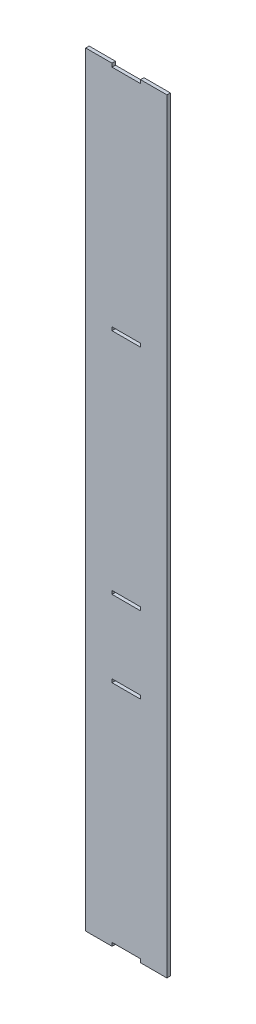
ISO-10303-21;
HEADER;
FILE_DESCRIPTION(('STEP AP214'),'2;1');
FILE_NAME('part.step','',(''),(''),'','','');
FILE_SCHEMA(('AUTOMOTIVE_DESIGN { 1 0 10303 214 1 1 1 1 }'));
ENDSEC;
DATA;
#1=APPLICATION_CONTEXT('core data for automotive mechanical design processes');
#2=APPLICATION_PROTOCOL_DEFINITION('international standard','automotive_design',2000,#1);
#3=PRODUCT_CONTEXT('',#1,'mechanical');
#4=PRODUCT('Part','Part','',(#3));
#5=PRODUCT_RELATED_PRODUCT_CATEGORY('part','',(#4));
#6=PRODUCT_DEFINITION_FORMATION('','',#4);
#7=PRODUCT_DEFINITION_CONTEXT('part definition',#1,'design');
#8=PRODUCT_DEFINITION('design','',#6,#7);
#9=PRODUCT_DEFINITION_SHAPE('','',#8);
#10=(LENGTH_UNIT() NAMED_UNIT(*) SI_UNIT(.MILLI.,.METRE.));
#11=(NAMED_UNIT(*) PLANE_ANGLE_UNIT() SI_UNIT($,.RADIAN.));
#12=(NAMED_UNIT(*) SI_UNIT($,.STERADIAN.) SOLID_ANGLE_UNIT());
#13=UNCERTAINTY_MEASURE_WITH_UNIT(LENGTH_MEASURE(1.E-05),#10,'distance_accuracy_value','');
#14=(GEOMETRIC_REPRESENTATION_CONTEXT(3) GLOBAL_UNCERTAINTY_ASSIGNED_CONTEXT((#13)) GLOBAL_UNIT_ASSIGNED_CONTEXT((#10,
#11,#12)) REPRESENTATION_CONTEXT('',''));
#15=CARTESIAN_POINT('',(0.,0.,0.));
#16=DIRECTION('',(0.,0.,1.));
#17=DIRECTION('',(1.,0.,0.));
#18=AXIS2_PLACEMENT_3D('',#15,#16,#17);
#19=CARTESIAN_POINT('',(0.,0.,1.524));
#20=DIRECTION('',(0.,0.,1.));
#21=DIRECTION('',(1.,0.,0.));
#22=AXIS2_PLACEMENT_3D('',#19,#20,#21);
#23=PLANE('',#22);
#24=DIRECTION('',(-1.,0.,0.));
#25=VECTOR('',#24,1.);
#26=CARTESIAN_POINT('',(6.35,135.649599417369,1.524));
#27=LINE('',#26,#25);
#28=CARTESIAN_POINT('',(6.35,135.649599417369,1.524));
#29=VERTEX_POINT('',#28);
#30=CARTESIAN_POINT('',(-6.35,135.649599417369,1.524));
#31=VERTEX_POINT('',#30);
#32=EDGE_CURVE('E233',#29,#31,#27,.T.);
#33=ORIENTED_EDGE('',*,*,#32,.F.);
#34=DIRECTION('',(0.,1.,0.));
#35=VECTOR('',#34,1.);
#36=CARTESIAN_POINT('',(6.35,135.649599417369,1.524));
#37=LINE('',#36,#35);
#38=CARTESIAN_POINT('',(6.35,134.125599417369,1.524));
#39=VERTEX_POINT('',#38);
#40=EDGE_CURVE('E231',#39,#29,#37,.T.);
#41=ORIENTED_EDGE('',*,*,#40,.F.);
#42=DIRECTION('',(1.,0.,0.));
#43=VECTOR('',#42,1.);
#44=CARTESIAN_POINT('',(6.35,134.125599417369,1.524));
#45=LINE('',#44,#43);
#46=CARTESIAN_POINT('',(-6.35,134.125599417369,1.524));
#47=VERTEX_POINT('',#46);
#48=EDGE_CURVE('E239',#47,#39,#45,.T.);
#49=ORIENTED_EDGE('',*,*,#48,.F.);
#50=DIRECTION('',(0.,-1.,0.));
#51=VECTOR('',#50,1.);
#52=CARTESIAN_POINT('',(-6.35,135.649599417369,1.524));
#53=LINE('',#52,#51);
#54=EDGE_CURVE('E236',#31,#47,#53,.T.);
#55=ORIENTED_EDGE('',*,*,#54,.F.);
#56=EDGE_LOOP('',(#33,#41,#49,#55));
#57=FACE_BOUND('',#56,.T.);
#58=DIRECTION('',(0.,1.,0.));
#59=VECTOR('',#58,1.);
#60=CARTESIAN_POINT('',(18.0600840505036,-1.524,1.524));
#61=LINE('',#60,#59);
#62=CARTESIAN_POINT('',(18.0600840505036,-1.524,1.524));
#63=VERTEX_POINT('',#62);
#64=CARTESIAN_POINT('',(18.0600840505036,338.849599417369,1.524));
#65=VERTEX_POINT('',#64);
#66=EDGE_CURVE('E293',#63,#65,#61,.T.);
#67=ORIENTED_EDGE('',*,*,#66,.T.);
#68=DIRECTION('',(-1.,0.,0.));
#69=VECTOR('',#68,1.);
#70=CARTESIAN_POINT('',(18.0600840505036,338.849599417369,1.524));
#71=LINE('',#70,#69);
#72=CARTESIAN_POINT('',(6.35,338.849599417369,1.524));
#73=VERTEX_POINT('',#72);
#74=EDGE_CURVE('E296',#65,#73,#71,.T.);
#75=ORIENTED_EDGE('',*,*,#74,.T.);
#76=DIRECTION('',(0.,-1.,0.));
#77=VECTOR('',#76,1.);
#78=CARTESIAN_POINT('',(6.35,337.325599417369,1.524));
#79=LINE('',#78,#77);
#80=CARTESIAN_POINT('',(6.35,337.325599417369,1.524));
#81=VERTEX_POINT('',#80);
#82=EDGE_CURVE('E299',#73,#81,#79,.T.);
#83=ORIENTED_EDGE('',*,*,#82,.T.);
#84=DIRECTION('',(-1.,0.,0.));
#85=VECTOR('',#84,1.);
#86=CARTESIAN_POINT('',(-6.35,337.325599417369,1.524));
#87=LINE('',#86,#85);
#88=CARTESIAN_POINT('',(-6.35,337.325599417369,1.524));
#89=VERTEX_POINT('',#88);
#90=EDGE_CURVE('E301',#81,#89,#87,.T.);
#91=ORIENTED_EDGE('',*,*,#90,.T.);
#92=DIRECTION('',(0.,1.,0.));
#93=VECTOR('',#92,1.);
#94=CARTESIAN_POINT('',(-6.35,338.849599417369,1.524));
#95=LINE('',#94,#93);
#96=CARTESIAN_POINT('',(-6.35,338.849599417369,1.524));
#97=VERTEX_POINT('',#96);
#98=EDGE_CURVE('E303',#89,#97,#95,.T.);
#99=ORIENTED_EDGE('',*,*,#98,.T.);
#100=DIRECTION('',(-1.,0.,0.));
#101=VECTOR('',#100,1.);
#102=CARTESIAN_POINT('',(-6.35,338.849599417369,1.524));
#103=LINE('',#102,#101);
#104=CARTESIAN_POINT('',(-18.0600840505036,338.849599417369,1.524));
#105=VERTEX_POINT('',#104);
#106=EDGE_CURVE('E305',#97,#105,#103,.T.);
#107=ORIENTED_EDGE('',*,*,#106,.T.);
#108=DIRECTION('',(0.,-1.,0.));
#109=VECTOR('',#108,1.);
#110=CARTESIAN_POINT('',(-18.0600840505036,-1.524,1.524));
#111=LINE('',#110,#109);
#112=CARTESIAN_POINT('',(-18.0600840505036,-1.524,1.524));
#113=VERTEX_POINT('',#112);
#114=EDGE_CURVE('E307',#105,#113,#111,.T.);
#115=ORIENTED_EDGE('',*,*,#114,.T.);
#116=DIRECTION('',(1.,0.,0.));
#117=VECTOR('',#116,1.);
#118=CARTESIAN_POINT('',(-6.35,-1.524,1.524));
#119=LINE('',#118,#117);
#120=CARTESIAN_POINT('',(-6.35,-1.524,1.524));
#121=VERTEX_POINT('',#120);
#122=EDGE_CURVE('E309',#113,#121,#119,.T.);
#123=ORIENTED_EDGE('',*,*,#122,.T.);
#124=DIRECTION('',(0.,1.,0.));
#125=VECTOR('',#124,1.);
#126=CARTESIAN_POINT('',(-6.35,0.,1.524));
#127=LINE('',#126,#125);
#128=CARTESIAN_POINT('',(-6.35,0.,1.524));
#129=VERTEX_POINT('',#128);
#130=EDGE_CURVE('E311',#121,#129,#127,.T.);
#131=ORIENTED_EDGE('',*,*,#130,.T.);
#132=DIRECTION('',(1.,0.,0.));
#133=VECTOR('',#132,1.);
#134=CARTESIAN_POINT('',(6.35,0.,1.524));
#135=LINE('',#134,#133);
#136=CARTESIAN_POINT('',(6.35,0.,1.524));
#137=VERTEX_POINT('',#136);
#138=EDGE_CURVE('E313',#129,#137,#135,.T.);
#139=ORIENTED_EDGE('',*,*,#138,.T.);
#140=DIRECTION('',(0.,-1.,0.));
#141=VECTOR('',#140,1.);
#142=CARTESIAN_POINT('',(6.35,-1.524,1.524));
#143=LINE('',#142,#141);
#144=CARTESIAN_POINT('',(6.35,-1.524,1.524));
#145=VERTEX_POINT('',#144);
#146=EDGE_CURVE('E315',#137,#145,#143,.T.);
#147=ORIENTED_EDGE('',*,*,#146,.T.);
#148=DIRECTION('',(1.,0.,0.));
#149=VECTOR('',#148,1.);
#150=CARTESIAN_POINT('',(18.0600840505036,-1.524,1.524));
#151=LINE('',#150,#149);
#152=EDGE_CURVE('E317',#145,#63,#151,.T.);
#153=ORIENTED_EDGE('',*,*,#152,.T.);
#154=EDGE_LOOP('',(#67,#75,#83,#91,#99,#107,#115,#123,#131,#139,#147,#153));
#155=FACE_BOUND('',#154,.T.);
#156=DIRECTION('',(-1.,0.,0.));
#157=VECTOR('',#156,1.);
#158=CARTESIAN_POINT('',(6.35,237.249599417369,1.524));
#159=LINE('',#158,#157);
#160=CARTESIAN_POINT('',(6.35,237.249599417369,1.524));
#161=VERTEX_POINT('',#160);
#162=CARTESIAN_POINT('',(-6.35,237.249599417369,1.524));
#163=VERTEX_POINT('',#162);
#164=EDGE_CURVE('E264',#161,#163,#159,.T.);
#165=ORIENTED_EDGE('',*,*,#164,.F.);
#166=DIRECTION('',(0.,1.,0.));
#167=VECTOR('',#166,1.);
#168=CARTESIAN_POINT('',(6.35,237.249599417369,1.524));
#169=LINE('',#168,#167);
#170=CARTESIAN_POINT('',(6.35,235.725599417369,1.524));
#171=VERTEX_POINT('',#170);
#172=EDGE_CURVE('E262',#171,#161,#169,.T.);
#173=ORIENTED_EDGE('',*,*,#172,.F.);
#174=DIRECTION('',(1.,0.,0.));
#175=VECTOR('',#174,1.);
#176=CARTESIAN_POINT('',(6.35,235.725599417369,1.524));
#177=LINE('',#176,#175);
#178=CARTESIAN_POINT('',(-6.35,235.725599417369,1.524));
#179=VERTEX_POINT('',#178);
#180=EDGE_CURVE('E270',#179,#171,#177,.T.);
#181=ORIENTED_EDGE('',*,*,#180,.F.);
#182=DIRECTION('',(0.,-1.,0.));
#183=VECTOR('',#182,1.);
#184=CARTESIAN_POINT('',(-6.35,237.249599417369,1.524));
#185=LINE('',#184,#183);
#186=EDGE_CURVE('E267',#163,#179,#185,.T.);
#187=ORIENTED_EDGE('',*,*,#186,.F.);
#188=EDGE_LOOP('',(#165,#173,#181,#187));
#189=FACE_BOUND('',#188,.T.);
#190=DIRECTION('',(-1.,0.,0.));
#191=VECTOR('',#190,1.);
#192=CARTESIAN_POINT('',(6.35,101.6,1.524));
#193=LINE('',#192,#191);
#194=CARTESIAN_POINT('',(6.35,101.6,1.524));
#195=VERTEX_POINT('',#194);
#196=CARTESIAN_POINT('',(-6.35,101.6,1.524));
#197=VERTEX_POINT('',#196);
#198=EDGE_CURVE('E203',#195,#197,#193,.T.);
#199=ORIENTED_EDGE('',*,*,#198,.F.);
#200=DIRECTION('',(0.,1.,0.));
#201=VECTOR('',#200,1.);
#202=CARTESIAN_POINT('',(6.35,101.6,1.524));
#203=LINE('',#202,#201);
#204=CARTESIAN_POINT('',(6.35,100.076,1.524));
#205=VERTEX_POINT('',#204);
#206=EDGE_CURVE('E195',#205,#195,#203,.T.);
#207=ORIENTED_EDGE('',*,*,#206,.F.);
#208=DIRECTION('',(1.,0.,0.));
#209=VECTOR('',#208,1.);
#210=CARTESIAN_POINT('',(6.35,100.076,1.524));
#211=LINE('',#210,#209);
#212=CARTESIAN_POINT('',(-6.35,100.076,1.524));
#213=VERTEX_POINT('',#212);
#214=EDGE_CURVE('E217',#213,#205,#211,.T.);
#215=ORIENTED_EDGE('',*,*,#214,.F.);
#216=DIRECTION('',(0.,-1.,0.));
#217=VECTOR('',#216,1.);
#218=CARTESIAN_POINT('',(-6.35,101.6,1.524));
#219=LINE('',#218,#217);
#220=EDGE_CURVE('E215',#197,#213,#219,.T.);
#221=ORIENTED_EDGE('',*,*,#220,.F.);
#222=EDGE_LOOP('',(#199,#207,#215,#221));
#223=FACE_BOUND('',#222,.T.);
#224=ADVANCED_FACE('F34',(#57,#155,#189,#223),#23,.T.);
#225=CARTESIAN_POINT('',(0.,0.,0.));
#226=DIRECTION('',(0.,0.,1.));
#227=DIRECTION('',(1.,0.,0.));
#228=AXIS2_PLACEMENT_3D('',#225,#226,#227);
#229=PLANE('',#228);
#230=DIRECTION('',(0.,1.,0.));
#231=VECTOR('',#230,1.);
#232=CARTESIAN_POINT('',(6.35,135.649599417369,0.));
#233=LINE('',#232,#231);
#234=CARTESIAN_POINT('',(6.35,134.125599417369,0.));
#235=VERTEX_POINT('',#234);
#236=CARTESIAN_POINT('',(6.35,135.649599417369,0.));
#237=VERTEX_POINT('',#236);
#238=EDGE_CURVE('E211',#235,#237,#233,.T.);
#239=ORIENTED_EDGE('',*,*,#238,.T.);
#240=DIRECTION('',(-1.,0.,0.));
#241=VECTOR('',#240,1.);
#242=CARTESIAN_POINT('',(6.35,135.649599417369,0.));
#243=LINE('',#242,#241);
#244=CARTESIAN_POINT('',(-6.35,135.649599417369,0.));
#245=VERTEX_POINT('',#244);
#246=EDGE_CURVE('E244',#237,#245,#243,.T.);
#247=ORIENTED_EDGE('',*,*,#246,.T.);
#248=DIRECTION('',(0.,-1.,0.));
#249=VECTOR('',#248,1.);
#250=CARTESIAN_POINT('',(-6.35,135.649599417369,0.));
#251=LINE('',#250,#249);
#252=CARTESIAN_POINT('',(-6.35,134.125599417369,0.));
#253=VERTEX_POINT('',#252);
#254=EDGE_CURVE('E247',#245,#253,#251,.T.);
#255=ORIENTED_EDGE('',*,*,#254,.T.);
#256=DIRECTION('',(1.,0.,0.));
#257=VECTOR('',#256,1.);
#258=CARTESIAN_POINT('',(6.35,134.125599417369,0.));
#259=LINE('',#258,#257);
#260=EDGE_CURVE('E234',#253,#235,#259,.T.);
#261=ORIENTED_EDGE('',*,*,#260,.T.);
#262=EDGE_LOOP('',(#239,#247,#255,#261));
#263=FACE_BOUND('',#262,.T.);
#264=DIRECTION('',(0.,1.,0.));
#265=VECTOR('',#264,1.);
#266=CARTESIAN_POINT('',(18.0600840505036,-1.524,0.));
#267=LINE('',#266,#265);
#268=CARTESIAN_POINT('',(18.0600840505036,-1.524,0.));
#269=VERTEX_POINT('',#268);
#270=CARTESIAN_POINT('',(18.0600840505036,338.849599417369,0.));
#271=VERTEX_POINT('',#270);
#272=EDGE_CURVE('E292',#269,#271,#267,.T.);
#273=ORIENTED_EDGE('',*,*,#272,.F.);
#274=DIRECTION('',(1.,0.,0.));
#275=VECTOR('',#274,1.);
#276=CARTESIAN_POINT('',(18.0600840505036,-1.524,0.));
#277=LINE('',#276,#275);
#278=CARTESIAN_POINT('',(6.35,-1.524,0.));
#279=VERTEX_POINT('',#278);
#280=EDGE_CURVE('E297',#279,#269,#277,.T.);
#281=ORIENTED_EDGE('',*,*,#280,.F.);
#282=DIRECTION('',(0.,-1.,0.));
#283=VECTOR('',#282,1.);
#284=CARTESIAN_POINT('',(6.35,-1.524,0.));
#285=LINE('',#284,#283);
#286=CARTESIAN_POINT('',(6.35,0.,0.));
#287=VERTEX_POINT('',#286);
#288=EDGE_CURVE('E340',#287,#279,#285,.T.);
#289=ORIENTED_EDGE('',*,*,#288,.F.);
#290=DIRECTION('',(1.,0.,0.));
#291=VECTOR('',#290,1.);
#292=CARTESIAN_POINT('',(6.35,0.,0.));
#293=LINE('',#292,#291);
#294=CARTESIAN_POINT('',(-6.35,0.,0.));
#295=VERTEX_POINT('',#294);
#296=EDGE_CURVE('E338',#295,#287,#293,.T.);
#297=ORIENTED_EDGE('',*,*,#296,.F.);
#298=DIRECTION('',(0.,1.,0.));
#299=VECTOR('',#298,1.);
#300=CARTESIAN_POINT('',(-6.35,0.,0.));
#301=LINE('',#300,#299);
#302=CARTESIAN_POINT('',(-6.35,-1.524,0.));
#303=VERTEX_POINT('',#302);
#304=EDGE_CURVE('E336',#303,#295,#301,.T.);
#305=ORIENTED_EDGE('',*,*,#304,.F.);
#306=DIRECTION('',(1.,0.,0.));
#307=VECTOR('',#306,1.);
#308=CARTESIAN_POINT('',(-6.35,-1.524,0.));
#309=LINE('',#308,#307);
#310=CARTESIAN_POINT('',(-18.0600840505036,-1.524,0.));
#311=VERTEX_POINT('',#310);
#312=EDGE_CURVE('E334',#311,#303,#309,.T.);
#313=ORIENTED_EDGE('',*,*,#312,.F.);
#314=DIRECTION('',(0.,-1.,0.));
#315=VECTOR('',#314,1.);
#316=CARTESIAN_POINT('',(-18.0600840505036,-1.524,0.));
#317=LINE('',#316,#315);
#318=CARTESIAN_POINT('',(-18.0600840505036,338.849599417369,0.));
#319=VERTEX_POINT('',#318);
#320=EDGE_CURVE('E332',#319,#311,#317,.T.);
#321=ORIENTED_EDGE('',*,*,#320,.F.);
#322=DIRECTION('',(-1.,0.,0.));
#323=VECTOR('',#322,1.);
#324=CARTESIAN_POINT('',(-6.35,338.849599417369,0.));
#325=LINE('',#324,#323);
#326=CARTESIAN_POINT('',(-6.35,338.849599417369,0.));
#327=VERTEX_POINT('',#326);
#328=EDGE_CURVE('E330',#327,#319,#325,.T.);
#329=ORIENTED_EDGE('',*,*,#328,.F.);
#330=DIRECTION('',(0.,1.,0.));
#331=VECTOR('',#330,1.);
#332=CARTESIAN_POINT('',(-6.35,338.849599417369,0.));
#333=LINE('',#332,#331);
#334=CARTESIAN_POINT('',(-6.35,337.325599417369,0.));
#335=VERTEX_POINT('',#334);
#336=EDGE_CURVE('E328',#335,#327,#333,.T.);
#337=ORIENTED_EDGE('',*,*,#336,.F.);
#338=DIRECTION('',(-1.,0.,0.));
#339=VECTOR('',#338,1.);
#340=CARTESIAN_POINT('',(-6.35,337.325599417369,0.));
#341=LINE('',#340,#339);
#342=CARTESIAN_POINT('',(6.35,337.325599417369,0.));
#343=VERTEX_POINT('',#342);
#344=EDGE_CURVE('E326',#343,#335,#341,.T.);
#345=ORIENTED_EDGE('',*,*,#344,.F.);
#346=DIRECTION('',(0.,-1.,0.));
#347=VECTOR('',#346,1.);
#348=CARTESIAN_POINT('',(6.35,337.325599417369,0.));
#349=LINE('',#348,#347);
#350=CARTESIAN_POINT('',(6.35,338.849599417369,0.));
#351=VERTEX_POINT('',#350);
#352=EDGE_CURVE('E324',#351,#343,#349,.T.);
#353=ORIENTED_EDGE('',*,*,#352,.F.);
#354=DIRECTION('',(-1.,0.,0.));
#355=VECTOR('',#354,1.);
#356=CARTESIAN_POINT('',(18.0600840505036,338.849599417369,0.));
#357=LINE('',#356,#355);
#358=EDGE_CURVE('E322',#271,#351,#357,.T.);
#359=ORIENTED_EDGE('',*,*,#358,.F.);
#360=EDGE_LOOP('',(#273,#281,#289,#297,#305,#313,#321,#329,#337,#345,#353,#359));
#361=FACE_BOUND('',#360,.T.);
#362=DIRECTION('',(0.,1.,0.));
#363=VECTOR('',#362,1.);
#364=CARTESIAN_POINT('',(6.35,237.249599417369,0.));
#365=LINE('',#364,#363);
#366=CARTESIAN_POINT('',(6.35,235.725599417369,0.));
#367=VERTEX_POINT('',#366);
#368=CARTESIAN_POINT('',(6.35,237.249599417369,0.));
#369=VERTEX_POINT('',#368);
#370=EDGE_CURVE('E261',#367,#369,#365,.T.);
#371=ORIENTED_EDGE('',*,*,#370,.T.);
#372=DIRECTION('',(-1.,0.,0.));
#373=VECTOR('',#372,1.);
#374=CARTESIAN_POINT('',(6.35,237.249599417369,0.));
#375=LINE('',#374,#373);
#376=CARTESIAN_POINT('',(-6.35,237.249599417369,0.));
#377=VERTEX_POINT('',#376);
#378=EDGE_CURVE('E275',#369,#377,#375,.T.);
#379=ORIENTED_EDGE('',*,*,#378,.T.);
#380=DIRECTION('',(0.,-1.,0.));
#381=VECTOR('',#380,1.);
#382=CARTESIAN_POINT('',(-6.35,237.249599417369,0.));
#383=LINE('',#382,#381);
#384=CARTESIAN_POINT('',(-6.35,235.725599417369,0.));
#385=VERTEX_POINT('',#384);
#386=EDGE_CURVE('E278',#377,#385,#383,.T.);
#387=ORIENTED_EDGE('',*,*,#386,.T.);
#388=DIRECTION('',(1.,0.,0.));
#389=VECTOR('',#388,1.);
#390=CARTESIAN_POINT('',(6.35,235.725599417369,0.));
#391=LINE('',#390,#389);
#392=EDGE_CURVE('E265',#385,#367,#391,.T.);
#393=ORIENTED_EDGE('',*,*,#392,.T.);
#394=EDGE_LOOP('',(#371,#379,#387,#393));
#395=FACE_BOUND('',#394,.T.);
#396=DIRECTION('',(0.,1.,0.));
#397=VECTOR('',#396,1.);
#398=CARTESIAN_POINT('',(6.35,101.6,0.));
#399=LINE('',#398,#397);
#400=CARTESIAN_POINT('',(6.35,100.076,0.));
#401=VERTEX_POINT('',#400);
#402=CARTESIAN_POINT('',(6.35,101.6,0.));
#403=VERTEX_POINT('',#402);
#404=EDGE_CURVE('E57',#401,#403,#399,.T.);
#405=ORIENTED_EDGE('',*,*,#404,.T.);
#406=DIRECTION('',(-1.,0.,0.));
#407=VECTOR('',#406,1.);
#408=CARTESIAN_POINT('',(6.35,101.6,0.));
#409=LINE('',#408,#407);
#410=CARTESIAN_POINT('',(-6.35,101.6,0.));
#411=VERTEX_POINT('',#410);
#412=EDGE_CURVE('E210',#403,#411,#409,.T.);
#413=ORIENTED_EDGE('',*,*,#412,.T.);
#414=DIRECTION('',(0.,-1.,0.));
#415=VECTOR('',#414,1.);
#416=CARTESIAN_POINT('',(-6.35,101.6,0.));
#417=LINE('',#416,#415);
#418=CARTESIAN_POINT('',(-6.35,100.076,0.));
#419=VERTEX_POINT('',#418);
#420=EDGE_CURVE('E223',#411,#419,#417,.T.);
#421=ORIENTED_EDGE('',*,*,#420,.T.);
#422=DIRECTION('',(1.,0.,0.));
#423=VECTOR('',#422,1.);
#424=CARTESIAN_POINT('',(6.35,100.076,0.));
#425=LINE('',#424,#423);
#426=EDGE_CURVE('E204',#419,#401,#425,.T.);
#427=ORIENTED_EDGE('',*,*,#426,.T.);
#428=EDGE_LOOP('',(#405,#413,#421,#427));
#429=FACE_BOUND('',#428,.T.);
#430=ADVANCED_FACE('F382',(#263,#361,#395,#429),#229,.F.);
#431=CARTESIAN_POINT('',(18.0600840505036,-1.524,1.524));
#432=DIRECTION('',(-1.,0.,0.));
#433=DIRECTION('',(0.,0.,1.));
#434=AXIS2_PLACEMENT_3D('',#431,#432,#433);
#435=PLANE('',#434);
#436=ORIENTED_EDGE('',*,*,#272,.T.);
#437=DIRECTION('',(0.,0.,-1.));
#438=VECTOR('',#437,1.);
#439=CARTESIAN_POINT('',(18.0600840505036,338.849599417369,1.524));
#440=LINE('',#439,#438);
#441=EDGE_CURVE('E11',#65,#271,#440,.T.);
#442=ORIENTED_EDGE('',*,*,#441,.F.);
#443=ORIENTED_EDGE('',*,*,#66,.F.);
#444=DIRECTION('',(0.,0.,-1.));
#445=VECTOR('',#444,1.);
#446=CARTESIAN_POINT('',(18.0600840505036,-1.524,1.524));
#447=LINE('',#446,#445);
#448=EDGE_CURVE('E319',#63,#269,#447,.T.);
#449=ORIENTED_EDGE('',*,*,#448,.T.);
#450=EDGE_LOOP('',(#436,#442,#443,#449));
#451=FACE_BOUND('',#450,.T.);
#452=ADVANCED_FACE('F36',(#451),#435,.F.);
#453=CARTESIAN_POINT('',(18.0600840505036,338.849599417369,1.524));
#454=DIRECTION('',(0.,-1.,0.));
#455=DIRECTION('',(0.,0.,-1.));
#456=AXIS2_PLACEMENT_3D('',#453,#454,#455);
#457=PLANE('',#456);
#458=ORIENTED_EDGE('',*,*,#358,.T.);
#459=DIRECTION('',(0.,0.,-1.));
#460=VECTOR('',#459,1.);
#461=CARTESIAN_POINT('',(6.35,338.849599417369,1.524));
#462=LINE('',#461,#460);
#463=EDGE_CURVE('E42',#73,#351,#462,.T.);
#464=ORIENTED_EDGE('',*,*,#463,.F.);
#465=ORIENTED_EDGE('',*,*,#74,.F.);
#466=ORIENTED_EDGE('',*,*,#441,.T.);
#467=EDGE_LOOP('',(#458,#464,#465,#466));
#468=FACE_BOUND('',#467,.T.);
#469=ADVANCED_FACE('F400',(#468),#457,.F.);
#470=CARTESIAN_POINT('',(6.35,337.325599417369,1.524));
#471=DIRECTION('',(1.,0.,0.));
#472=DIRECTION('',(0.,0.,-1.));
#473=AXIS2_PLACEMENT_3D('',#470,#471,#472);
#474=PLANE('',#473);
#475=ORIENTED_EDGE('',*,*,#352,.T.);
#476=DIRECTION('',(0.,0.,-1.));
#477=VECTOR('',#476,1.);
#478=CARTESIAN_POINT('',(6.35,337.325599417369,1.524));
#479=LINE('',#478,#477);
#480=EDGE_CURVE('E369',#81,#343,#479,.T.);
#481=ORIENTED_EDGE('',*,*,#480,.F.);
#482=ORIENTED_EDGE('',*,*,#82,.F.);
#483=ORIENTED_EDGE('',*,*,#463,.T.);
#484=EDGE_LOOP('',(#475,#481,#482,#483));
#485=FACE_BOUND('',#484,.T.);
#486=ADVANCED_FACE('F376',(#485),#474,.F.);
#487=CARTESIAN_POINT('',(-6.35,337.325599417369,1.524));
#488=DIRECTION('',(0.,-1.,0.));
#489=DIRECTION('',(0.,0.,-1.));
#490=AXIS2_PLACEMENT_3D('',#487,#488,#489);
#491=PLANE('',#490);
#492=ORIENTED_EDGE('',*,*,#344,.T.);
#493=DIRECTION('',(0.,0.,-1.));
#494=VECTOR('',#493,1.);
#495=CARTESIAN_POINT('',(-6.35,337.325599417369,1.524));
#496=LINE('',#495,#494);
#497=EDGE_CURVE('E366',#89,#335,#496,.T.);
#498=ORIENTED_EDGE('',*,*,#497,.F.);
#499=ORIENTED_EDGE('',*,*,#90,.F.);
#500=ORIENTED_EDGE('',*,*,#480,.T.);
#501=EDGE_LOOP('',(#492,#498,#499,#500));
#502=FACE_BOUND('',#501,.T.);
#503=ADVANCED_FACE('F388',(#502),#491,.F.);
#504=CARTESIAN_POINT('',(-6.35,338.849599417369,1.524));
#505=DIRECTION('',(-1.,0.,0.));
#506=DIRECTION('',(0.,0.,1.));
#507=AXIS2_PLACEMENT_3D('',#504,#505,#506);
#508=PLANE('',#507);
#509=ORIENTED_EDGE('',*,*,#336,.T.);
#510=DIRECTION('',(0.,0.,-1.));
#511=VECTOR('',#510,1.);
#512=CARTESIAN_POINT('',(-6.35,338.849599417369,1.524));
#513=LINE('',#512,#511);
#514=EDGE_CURVE('E363',#97,#327,#513,.T.);
#515=ORIENTED_EDGE('',*,*,#514,.F.);
#516=ORIENTED_EDGE('',*,*,#98,.F.);
#517=ORIENTED_EDGE('',*,*,#497,.T.);
#518=EDGE_LOOP('',(#509,#515,#516,#517));
#519=FACE_BOUND('',#518,.T.);
#520=ADVANCED_FACE('F392',(#519),#508,.F.);
#521=CARTESIAN_POINT('',(-6.35,338.849599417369,1.524));
#522=DIRECTION('',(0.,-1.,0.));
#523=DIRECTION('',(0.,0.,-1.));
#524=AXIS2_PLACEMENT_3D('',#521,#522,#523);
#525=PLANE('',#524);
#526=ORIENTED_EDGE('',*,*,#328,.T.);
#527=DIRECTION('',(0.,0.,-1.));
#528=VECTOR('',#527,1.);
#529=CARTESIAN_POINT('',(-18.0600840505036,338.849599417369,1.524));
#530=LINE('',#529,#528);
#531=EDGE_CURVE('E360',#105,#319,#530,.T.);
#532=ORIENTED_EDGE('',*,*,#531,.F.);
#533=ORIENTED_EDGE('',*,*,#106,.F.);
#534=ORIENTED_EDGE('',*,*,#514,.T.);
#535=EDGE_LOOP('',(#526,#532,#533,#534));
#536=FACE_BOUND('',#535,.T.);
#537=ADVANCED_FACE('F433',(#536),#525,.F.);
#538=CARTESIAN_POINT('',(-18.0600840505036,-1.524,1.524));
#539=DIRECTION('',(1.,0.,0.));
#540=DIRECTION('',(0.,0.,-1.));
#541=AXIS2_PLACEMENT_3D('',#538,#539,#540);
#542=PLANE('',#541);
#543=ORIENTED_EDGE('',*,*,#320,.T.);
#544=DIRECTION('',(0.,0.,-1.));
#545=VECTOR('',#544,1.);
#546=CARTESIAN_POINT('',(-18.0600840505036,-1.524,1.524));
#547=LINE('',#546,#545);
#548=EDGE_CURVE('E357',#113,#311,#547,.T.);
#549=ORIENTED_EDGE('',*,*,#548,.F.);
#550=ORIENTED_EDGE('',*,*,#114,.F.);
#551=ORIENTED_EDGE('',*,*,#531,.T.);
#552=EDGE_LOOP('',(#543,#549,#550,#551));
#553=FACE_BOUND('',#552,.T.);
#554=ADVANCED_FACE('F431',(#553),#542,.F.);
#555=CARTESIAN_POINT('',(-6.35,-1.524,1.524));
#556=DIRECTION('',(0.,1.,0.));
#557=DIRECTION('',(0.,0.,1.));
#558=AXIS2_PLACEMENT_3D('',#555,#556,#557);
#559=PLANE('',#558);
#560=ORIENTED_EDGE('',*,*,#312,.T.);
#561=DIRECTION('',(0.,0.,-1.));
#562=VECTOR('',#561,1.);
#563=CARTESIAN_POINT('',(-6.35,-1.524,1.524));
#564=LINE('',#563,#562);
#565=EDGE_CURVE('E354',#121,#303,#564,.T.);
#566=ORIENTED_EDGE('',*,*,#565,.F.);
#567=ORIENTED_EDGE('',*,*,#122,.F.);
#568=ORIENTED_EDGE('',*,*,#548,.T.);
#569=EDGE_LOOP('',(#560,#566,#567,#568));
#570=FACE_BOUND('',#569,.T.);
#571=ADVANCED_FACE('F427',(#570),#559,.F.);
#572=CARTESIAN_POINT('',(-6.35,0.,1.524));
#573=DIRECTION('',(-1.,0.,0.));
#574=DIRECTION('',(0.,0.,1.));
#575=AXIS2_PLACEMENT_3D('',#572,#573,#574);
#576=PLANE('',#575);
#577=ORIENTED_EDGE('',*,*,#304,.T.);
#578=DIRECTION('',(0.,0.,-1.));
#579=VECTOR('',#578,1.);
#580=CARTESIAN_POINT('',(-6.35,0.,1.524));
#581=LINE('',#580,#579);
#582=EDGE_CURVE('E351',#129,#295,#581,.T.);
#583=ORIENTED_EDGE('',*,*,#582,.F.);
#584=ORIENTED_EDGE('',*,*,#130,.F.);
#585=ORIENTED_EDGE('',*,*,#565,.T.);
#586=EDGE_LOOP('',(#577,#583,#584,#585));
#587=FACE_BOUND('',#586,.T.);
#588=ADVANCED_FACE('F422',(#587),#576,.F.);
#589=CARTESIAN_POINT('',(6.35,0.,1.524));
#590=DIRECTION('',(0.,1.,0.));
#591=DIRECTION('',(0.,0.,1.));
#592=AXIS2_PLACEMENT_3D('',#589,#590,#591);
#593=PLANE('',#592);
#594=ORIENTED_EDGE('',*,*,#296,.T.);
#595=DIRECTION('',(0.,0.,-1.));
#596=VECTOR('',#595,1.);
#597=CARTESIAN_POINT('',(6.35,0.,1.524));
#598=LINE('',#597,#596);
#599=EDGE_CURVE('E348',#137,#287,#598,.T.);
#600=ORIENTED_EDGE('',*,*,#599,.F.);
#601=ORIENTED_EDGE('',*,*,#138,.F.);
#602=ORIENTED_EDGE('',*,*,#582,.T.);
#603=EDGE_LOOP('',(#594,#600,#601,#602));
#604=FACE_BOUND('',#603,.T.);
#605=ADVANCED_FACE('F416',(#604),#593,.F.);
#606=CARTESIAN_POINT('',(6.35,-1.524,1.524));
#607=DIRECTION('',(1.,0.,0.));
#608=DIRECTION('',(0.,0.,-1.));
#609=AXIS2_PLACEMENT_3D('',#606,#607,#608);
#610=PLANE('',#609);
#611=ORIENTED_EDGE('',*,*,#288,.T.);
#612=DIRECTION('',(0.,0.,-1.));
#613=VECTOR('',#612,1.);
#614=CARTESIAN_POINT('',(6.35,-1.524,1.524));
#615=LINE('',#614,#613);
#616=EDGE_CURVE('E345',#145,#279,#615,.T.);
#617=ORIENTED_EDGE('',*,*,#616,.F.);
#618=ORIENTED_EDGE('',*,*,#146,.F.);
#619=ORIENTED_EDGE('',*,*,#599,.T.);
#620=EDGE_LOOP('',(#611,#617,#618,#619));
#621=FACE_BOUND('',#620,.T.);
#622=ADVANCED_FACE('F412',(#621),#610,.F.);
#623=CARTESIAN_POINT('',(18.0600840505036,-1.524,1.524));
#624=DIRECTION('',(0.,1.,0.));
#625=DIRECTION('',(0.,0.,1.));
#626=AXIS2_PLACEMENT_3D('',#623,#624,#625);
#627=PLANE('',#626);
#628=ORIENTED_EDGE('',*,*,#280,.T.);
#629=ORIENTED_EDGE('',*,*,#448,.F.);
#630=ORIENTED_EDGE('',*,*,#152,.F.);
#631=ORIENTED_EDGE('',*,*,#616,.T.);
#632=EDGE_LOOP('',(#628,#629,#630,#631));
#633=FACE_BOUND('',#632,.T.);
#634=ADVANCED_FACE('F407',(#633),#627,.F.);
#635=CARTESIAN_POINT('',(6.35,237.249599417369,1.524));
#636=DIRECTION('',(-1.,0.,0.));
#637=DIRECTION('',(0.,0.,1.));
#638=AXIS2_PLACEMENT_3D('',#635,#636,#637);
#639=PLANE('',#638);
#640=ORIENTED_EDGE('',*,*,#370,.F.);
#641=DIRECTION('',(0.,0.,-1.));
#642=VECTOR('',#641,1.);
#643=CARTESIAN_POINT('',(6.35,235.725599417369,1.524));
#644=LINE('',#643,#642);
#645=EDGE_CURVE('E272',#171,#367,#644,.T.);
#646=ORIENTED_EDGE('',*,*,#645,.F.);
#647=ORIENTED_EDGE('',*,*,#172,.T.);
#648=DIRECTION('',(0.,0.,-1.));
#649=VECTOR('',#648,1.);
#650=CARTESIAN_POINT('',(6.35,237.249599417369,1.524));
#651=LINE('',#650,#649);
#652=EDGE_CURVE('E289',#161,#369,#651,.T.);
#653=ORIENTED_EDGE('',*,*,#652,.T.);
#654=EDGE_LOOP('',(#640,#646,#647,#653));
#655=FACE_BOUND('',#654,.T.);
#656=ADVANCED_FACE('F452',(#655),#639,.T.);
#657=CARTESIAN_POINT('',(6.35,237.249599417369,1.524));
#658=DIRECTION('',(0.,-1.,0.));
#659=DIRECTION('',(0.,0.,-1.));
#660=AXIS2_PLACEMENT_3D('',#657,#658,#659);
#661=PLANE('',#660);
#662=ORIENTED_EDGE('',*,*,#378,.F.);
#663=ORIENTED_EDGE('',*,*,#652,.F.);
#664=ORIENTED_EDGE('',*,*,#164,.T.);
#665=DIRECTION('',(0.,0.,-1.));
#666=VECTOR('',#665,1.);
#667=CARTESIAN_POINT('',(-6.35,237.249599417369,1.524));
#668=LINE('',#667,#666);
#669=EDGE_CURVE('E287',#163,#377,#668,.T.);
#670=ORIENTED_EDGE('',*,*,#669,.T.);
#671=EDGE_LOOP('',(#662,#663,#664,#670));
#672=FACE_BOUND('',#671,.T.);
#673=ADVANCED_FACE('F490',(#672),#661,.T.);
#674=CARTESIAN_POINT('',(-6.35,237.249599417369,1.524));
#675=DIRECTION('',(1.,0.,0.));
#676=DIRECTION('',(0.,0.,-1.));
#677=AXIS2_PLACEMENT_3D('',#674,#675,#676);
#678=PLANE('',#677);
#679=ORIENTED_EDGE('',*,*,#386,.F.);
#680=ORIENTED_EDGE('',*,*,#669,.F.);
#681=ORIENTED_EDGE('',*,*,#186,.T.);
#682=DIRECTION('',(0.,0.,-1.));
#683=VECTOR('',#682,1.);
#684=CARTESIAN_POINT('',(-6.35,235.725599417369,1.524));
#685=LINE('',#684,#683);
#686=EDGE_CURVE('E285',#179,#385,#685,.T.);
#687=ORIENTED_EDGE('',*,*,#686,.T.);
#688=EDGE_LOOP('',(#679,#680,#681,#687));
#689=FACE_BOUND('',#688,.T.);
#690=ADVANCED_FACE('F497',(#689),#678,.T.);
#691=CARTESIAN_POINT('',(6.35,235.725599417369,1.524));
#692=DIRECTION('',(0.,1.,0.));
#693=DIRECTION('',(0.,0.,1.));
#694=AXIS2_PLACEMENT_3D('',#691,#692,#693);
#695=PLANE('',#694);
#696=ORIENTED_EDGE('',*,*,#392,.F.);
#697=ORIENTED_EDGE('',*,*,#686,.F.);
#698=ORIENTED_EDGE('',*,*,#180,.T.);
#699=ORIENTED_EDGE('',*,*,#645,.T.);
#700=EDGE_LOOP('',(#696,#697,#698,#699));
#701=FACE_BOUND('',#700,.T.);
#702=ADVANCED_FACE('F504',(#701),#695,.T.);
#703=CARTESIAN_POINT('',(6.35,135.649599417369,1.524));
#704=DIRECTION('',(-1.,0.,0.));
#705=DIRECTION('',(0.,0.,1.));
#706=AXIS2_PLACEMENT_3D('',#703,#704,#705);
#707=PLANE('',#706);
#708=ORIENTED_EDGE('',*,*,#238,.F.);
#709=DIRECTION('',(0.,0.,-1.));
#710=VECTOR('',#709,1.);
#711=CARTESIAN_POINT('',(6.35,134.125599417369,1.524));
#712=LINE('',#711,#710);
#713=EDGE_CURVE('E241',#39,#235,#712,.T.);
#714=ORIENTED_EDGE('',*,*,#713,.F.);
#715=ORIENTED_EDGE('',*,*,#40,.T.);
#716=DIRECTION('',(0.,0.,-1.));
#717=VECTOR('',#716,1.);
#718=CARTESIAN_POINT('',(6.35,135.649599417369,1.524));
#719=LINE('',#718,#717);
#720=EDGE_CURVE('E258',#29,#237,#719,.T.);
#721=ORIENTED_EDGE('',*,*,#720,.T.);
#722=EDGE_LOOP('',(#708,#714,#715,#721));
#723=FACE_BOUND('',#722,.T.);
#724=ADVANCED_FACE('F512',(#723),#707,.T.);
#725=CARTESIAN_POINT('',(6.35,135.649599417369,1.524));
#726=DIRECTION('',(0.,-1.,0.));
#727=DIRECTION('',(0.,0.,-1.));
#728=AXIS2_PLACEMENT_3D('',#725,#726,#727);
#729=PLANE('',#728);
#730=ORIENTED_EDGE('',*,*,#246,.F.);
#731=ORIENTED_EDGE('',*,*,#720,.F.);
#732=ORIENTED_EDGE('',*,*,#32,.T.);
#733=DIRECTION('',(0.,0.,-1.));
#734=VECTOR('',#733,1.);
#735=CARTESIAN_POINT('',(-6.35,135.649599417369,1.524));
#736=LINE('',#735,#734);
#737=EDGE_CURVE('E256',#31,#245,#736,.T.);
#738=ORIENTED_EDGE('',*,*,#737,.T.);
#739=EDGE_LOOP('',(#730,#731,#732,#738));
#740=FACE_BOUND('',#739,.T.);
#741=ADVANCED_FACE('F520',(#740),#729,.T.);
#742=CARTESIAN_POINT('',(-6.35,135.649599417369,1.524));
#743=DIRECTION('',(1.,0.,0.));
#744=DIRECTION('',(0.,0.,-1.));
#745=AXIS2_PLACEMENT_3D('',#742,#743,#744);
#746=PLANE('',#745);
#747=ORIENTED_EDGE('',*,*,#254,.F.);
#748=ORIENTED_EDGE('',*,*,#737,.F.);
#749=ORIENTED_EDGE('',*,*,#54,.T.);
#750=DIRECTION('',(0.,0.,-1.));
#751=VECTOR('',#750,1.);
#752=CARTESIAN_POINT('',(-6.35,134.125599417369,1.524));
#753=LINE('',#752,#751);
#754=EDGE_CURVE('E254',#47,#253,#753,.T.);
#755=ORIENTED_EDGE('',*,*,#754,.T.);
#756=EDGE_LOOP('',(#747,#748,#749,#755));
#757=FACE_BOUND('',#756,.T.);
#758=ADVANCED_FACE('F528',(#757),#746,.T.);
#759=CARTESIAN_POINT('',(6.35,134.125599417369,1.524));
#760=DIRECTION('',(0.,1.,0.));
#761=DIRECTION('',(0.,0.,1.));
#762=AXIS2_PLACEMENT_3D('',#759,#760,#761);
#763=PLANE('',#762);
#764=ORIENTED_EDGE('',*,*,#260,.F.);
#765=ORIENTED_EDGE('',*,*,#754,.F.);
#766=ORIENTED_EDGE('',*,*,#48,.T.);
#767=ORIENTED_EDGE('',*,*,#713,.T.);
#768=EDGE_LOOP('',(#764,#765,#766,#767));
#769=FACE_BOUND('',#768,.T.);
#770=ADVANCED_FACE('F536',(#769),#763,.T.);
#771=CARTESIAN_POINT('',(6.35,101.6,1.524));
#772=DIRECTION('',(-1.,0.,0.));
#773=DIRECTION('',(0.,0.,1.));
#774=AXIS2_PLACEMENT_3D('',#771,#772,#773);
#775=PLANE('',#774);
#776=ORIENTED_EDGE('',*,*,#404,.F.);
#777=DIRECTION('',(0.,0.,-1.));
#778=VECTOR('',#777,1.);
#779=CARTESIAN_POINT('',(6.35,100.076,1.524));
#780=LINE('',#779,#778);
#781=EDGE_CURVE('E199',#205,#401,#780,.T.);
#782=ORIENTED_EDGE('',*,*,#781,.F.);
#783=ORIENTED_EDGE('',*,*,#206,.T.);
#784=DIRECTION('',(0.,0.,-1.));
#785=VECTOR('',#784,1.);
#786=CARTESIAN_POINT('',(6.35,101.6,1.524));
#787=LINE('',#786,#785);
#788=EDGE_CURVE('E198',#195,#403,#787,.T.);
#789=ORIENTED_EDGE('',*,*,#788,.T.);
#790=EDGE_LOOP('',(#776,#782,#783,#789));
#791=FACE_BOUND('',#790,.T.);
#792=ADVANCED_FACE('F197',(#791),#775,.T.);
#793=CARTESIAN_POINT('',(6.35,101.6,1.524));
#794=DIRECTION('',(0.,-1.,0.));
#795=DIRECTION('',(0.,0.,-1.));
#796=AXIS2_PLACEMENT_3D('',#793,#794,#795);
#797=PLANE('',#796);
#798=ORIENTED_EDGE('',*,*,#412,.F.);
#799=ORIENTED_EDGE('',*,*,#788,.F.);
#800=ORIENTED_EDGE('',*,*,#198,.T.);
#801=DIRECTION('',(0.,0.,-1.));
#802=VECTOR('',#801,1.);
#803=CARTESIAN_POINT('',(-6.35,101.6,1.524));
#804=LINE('',#803,#802);
#805=EDGE_CURVE('E212',#197,#411,#804,.T.);
#806=ORIENTED_EDGE('',*,*,#805,.T.);
#807=EDGE_LOOP('',(#798,#799,#800,#806));
#808=FACE_BOUND('',#807,.T.);
#809=ADVANCED_FACE('F207',(#808),#797,.T.);
#810=CARTESIAN_POINT('',(-6.35,101.6,1.524));
#811=DIRECTION('',(1.,0.,0.));
#812=DIRECTION('',(0.,0.,-1.));
#813=AXIS2_PLACEMENT_3D('',#810,#811,#812);
#814=PLANE('',#813);
#815=ORIENTED_EDGE('',*,*,#420,.F.);
#816=ORIENTED_EDGE('',*,*,#805,.F.);
#817=ORIENTED_EDGE('',*,*,#220,.T.);
#818=DIRECTION('',(0.,0.,-1.));
#819=VECTOR('',#818,1.);
#820=CARTESIAN_POINT('',(-6.35,100.076,1.524));
#821=LINE('',#820,#819);
#822=EDGE_CURVE('E49',#213,#419,#821,.T.);
#823=ORIENTED_EDGE('',*,*,#822,.T.);
#824=EDGE_LOOP('',(#815,#816,#817,#823));
#825=FACE_BOUND('',#824,.T.);
#826=ADVANCED_FACE('F557',(#825),#814,.T.);
#827=CARTESIAN_POINT('',(6.35,100.076,1.524));
#828=DIRECTION('',(0.,1.,0.));
#829=DIRECTION('',(0.,0.,1.));
#830=AXIS2_PLACEMENT_3D('',#827,#828,#829);
#831=PLANE('',#830);
#832=ORIENTED_EDGE('',*,*,#426,.F.);
#833=ORIENTED_EDGE('',*,*,#822,.F.);
#834=ORIENTED_EDGE('',*,*,#214,.T.);
#835=ORIENTED_EDGE('',*,*,#781,.T.);
#836=EDGE_LOOP('',(#832,#833,#834,#835));
#837=FACE_BOUND('',#836,.T.);
#838=ADVANCED_FACE('F564',(#837),#831,.T.);
#839=CLOSED_SHELL('',(#224,#430,#452,#469,#486,#503,#520,#537,#554,#571,#588,#605,#622,#634,
#656,#673,#690,#702,#724,#741,#758,#770,#792,#809,#826,#838));
#840=MANIFOLD_SOLID_BREP('B2',#839);
#841=ADVANCED_BREP_SHAPE_REPRESENTATION('',(#18,#840),#14);
#842=SHAPE_DEFINITION_REPRESENTATION(#9,#841);
ENDSEC;
END-ISO-10303-21;
